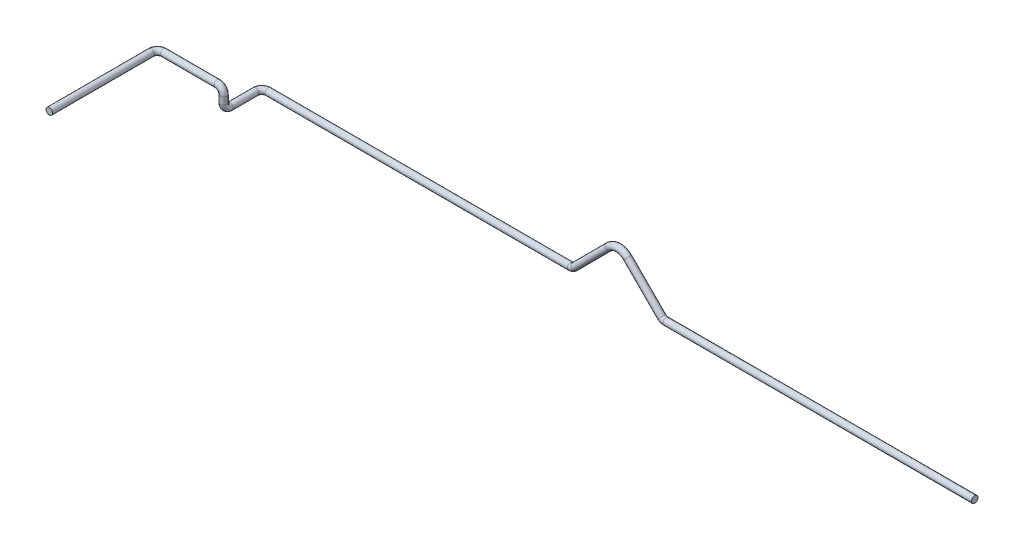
from build123d import *

# Parameters (mm, degrees)
SKETCH3_R = 0.7874


with BuildPart() as part:
    # Sweep1: sweep along a curve in space
    with BuildLine() as sweep1_path:
        Line((11.491439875, 0, 0), (85.725, 0, 0))
        ThreePointArc((11.491439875, 0, 0), (10.906907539, 0.116556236, 0), (10.411785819, 0.448396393, 0))
        Line((2.249279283, 8.641640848, 0), (10.411785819, 0.448396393, 0))
        ThreePointArc((2.249279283, 8.641640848, 0), (0, 9.5758, 0), (-2.249279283, 8.641640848, 0))
        Line((-2.249279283, 8.641640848, 0), (-10.411785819, 0.448396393, 0))
        ThreePointArc((-10.411785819, 0.448396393, 0), (-10.906907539, 0.116556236, 0), (-11.491439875, 0, 0))
        Line((-11.491439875, 0, 0), (-84.201, 0, 0))
        ThreePointArc((-84.201, 0, 0), (-85.278630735, 0, 0.446369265), (-85.725, 0, 1.524))
        Line((-85.725, 0, 1.524), (-85.725, 0, 7.6708))
        ThreePointArc((-85.725, 0, 7.6708), (-85.725, 0.446369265, 8.748430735), (-85.725, 1.524, 9.1948))
        Line((-85.725, 1.524, 9.1948), (-85.725, 3.2385, 9.1948))
        ThreePointArc((-85.725, 3.2385, 9.1948), (-86.171369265, 4.316130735, 9.1948), (-87.249, 4.7625, 9.1948))
        Line((-87.249, 4.7625, 9.1948), (-100.1268, 4.7625, 9.1948))
        ThreePointArc((-100.1268, 4.7625, 9.1948), (-101.204430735, 4.7625, 9.641169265), (-101.6508, 4.7625, 10.7188))
        Line((-101.6508, 4.7625, 10.7188), (-101.6508, 4.7625, 35.2044))
    # Sketch3 → Sweep1 (sweep)
    with BuildSketch(Plane(origin=(-101.6508, 4.7625, 35.2044), x_dir=(1, 0, 0), z_dir=(0, 0, 1))):
        Circle(SKETCH3_R)
    sweep(path=sweep1_path.line)


solid = part.part
